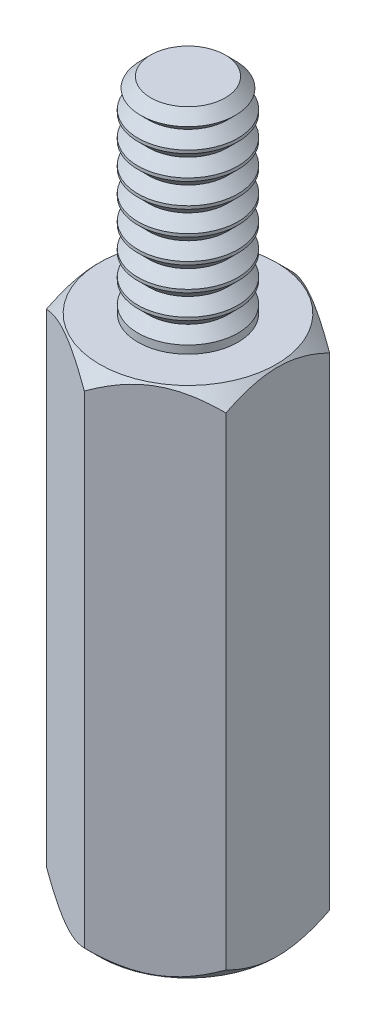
ISO-10303-21;
HEADER;
FILE_DESCRIPTION(('STEP AP214'),'2;1');
FILE_NAME('part.step','',(''),(''),'','','');
FILE_SCHEMA(('AUTOMOTIVE_DESIGN { 1 0 10303 214 1 1 1 1 }'));
ENDSEC;
DATA;
#1=APPLICATION_CONTEXT('core data for automotive mechanical design processes');
#2=APPLICATION_PROTOCOL_DEFINITION('international standard','automotive_design',2000,#1);
#3=PRODUCT_CONTEXT('',#1,'mechanical');
#4=PRODUCT('Part','Part','',(#3));
#5=PRODUCT_RELATED_PRODUCT_CATEGORY('part','',(#4));
#6=PRODUCT_DEFINITION_FORMATION('','',#4);
#7=PRODUCT_DEFINITION_CONTEXT('part definition',#1,'design');
#8=PRODUCT_DEFINITION('design','',#6,#7);
#9=PRODUCT_DEFINITION_SHAPE('','',#8);
#10=(LENGTH_UNIT() NAMED_UNIT(*) SI_UNIT(.MILLI.,.METRE.));
#11=(NAMED_UNIT(*) PLANE_ANGLE_UNIT() SI_UNIT($,.RADIAN.));
#12=(NAMED_UNIT(*) SI_UNIT($,.STERADIAN.) SOLID_ANGLE_UNIT());
#13=UNCERTAINTY_MEASURE_WITH_UNIT(LENGTH_MEASURE(1.E-05),#10,'distance_accuracy_value','');
#14=(GEOMETRIC_REPRESENTATION_CONTEXT(3) GLOBAL_UNCERTAINTY_ASSIGNED_CONTEXT((#13)) GLOBAL_UNIT_ASSIGNED_CONTEXT((#10,
#11,#12)) REPRESENTATION_CONTEXT('',''));
#15=CARTESIAN_POINT('',(0.,0.,0.));
#16=DIRECTION('',(0.,0.,1.));
#17=DIRECTION('',(1.,0.,0.));
#18=AXIS2_PLACEMENT_3D('',#15,#16,#17);
#19=CARTESIAN_POINT('',(0.,28.,0.));
#20=DIRECTION('',(0.,-1.,0.));
#21=DIRECTION('',(0.,0.,-1.));
#22=AXIS2_PLACEMENT_3D('',#19,#20,#21);
#23=CYLINDRICAL_SURFACE('',#22,1.95);
#24=CARTESIAN_POINT('',(0.,23.9502438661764,0.));
#25=DIRECTION('',(0.,-1.,0.));
#26=DIRECTION('',(0.,0.,-1.));
#27=AXIS2_PLACEMENT_3D('',#24,#25,#26);
#28=CIRCLE('',#27,1.95000000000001);
#29=CARTESIAN_POINT('',(0.,23.9502438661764,-1.95000000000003));
#30=VERTEX_POINT('',#29);
#31=EDGE_CURVE('E320',#30,#30,#28,.T.);
#32=ORIENTED_EDGE('',*,*,#31,.F.);
#33=EDGE_LOOP('',(#32));
#34=FACE_BOUND('',#33,.T.);
#35=CARTESIAN_POINT('',(0.,24.07,0.));
#36=DIRECTION('',(0.,-1.,0.));
#37=DIRECTION('',(0.,0.,-1.));
#38=AXIS2_PLACEMENT_3D('',#35,#36,#37);
#39=CIRCLE('',#38,1.95000000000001);
#40=CARTESIAN_POINT('',(0.,24.07,-1.95000000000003));
#41=VERTEX_POINT('',#40);
#42=EDGE_CURVE('E635',#41,#41,#39,.T.);
#43=ORIENTED_EDGE('',*,*,#42,.T.);
#44=EDGE_LOOP('',(#43));
#45=FACE_BOUND('',#44,.T.);
#46=ADVANCED_FACE('F34',(#34,#45),#23,.T.);
#47=CARTESIAN_POINT('',(0.,21.25,0.));
#48=DIRECTION('',(0.,-1.,0.));
#49=DIRECTION('',(0.,0.,-1.));
#50=AXIS2_PLACEMENT_3D('',#47,#48,#49);
#51=CIRCLE('',#50,1.95000000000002);
#52=CARTESIAN_POINT('',(0.,21.25,-1.95000000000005));
#53=VERTEX_POINT('',#52);
#54=EDGE_CURVE('E314',#53,#53,#51,.T.);
#55=ORIENTED_EDGE('',*,*,#54,.T.);
#56=EDGE_LOOP('',(#55));
#57=FACE_BOUND('',#56,.T.);
#58=CARTESIAN_POINT('',(0.,21.1302438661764,0.));
#59=DIRECTION('',(0.,-1.,0.));
#60=DIRECTION('',(0.,0.,-1.));
#61=AXIS2_PLACEMENT_3D('',#58,#59,#60);
#62=CIRCLE('',#61,1.95000000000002);
#63=CARTESIAN_POINT('',(0.,21.1302438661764,-1.95000000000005));
#64=VERTEX_POINT('',#63);
#65=EDGE_CURVE('E363',#64,#64,#62,.T.);
#66=ORIENTED_EDGE('',*,*,#65,.F.);
#67=EDGE_LOOP('',(#66));
#68=FACE_BOUND('',#67,.T.);
#69=ADVANCED_FACE('F240',(#57,#68),#23,.T.);
#70=CARTESIAN_POINT('',(0.,22.19,0.));
#71=DIRECTION('',(0.,-1.,0.));
#72=DIRECTION('',(0.,0.,-1.));
#73=AXIS2_PLACEMENT_3D('',#70,#71,#72);
#74=CIRCLE('',#73,1.95000000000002);
#75=CARTESIAN_POINT('',(0.,22.19,-1.95000000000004));
#76=VERTEX_POINT('',#75);
#77=EDGE_CURVE('E307',#76,#76,#74,.T.);
#78=ORIENTED_EDGE('',*,*,#77,.T.);
#79=EDGE_LOOP('',(#78));
#80=FACE_BOUND('',#79,.T.);
#81=CARTESIAN_POINT('',(0.,22.0702438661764,0.));
#82=DIRECTION('',(0.,-1.,0.));
#83=DIRECTION('',(0.,0.,-1.));
#84=AXIS2_PLACEMENT_3D('',#81,#82,#83);
#85=CIRCLE('',#84,1.95000000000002);
#86=CARTESIAN_POINT('',(0.,22.0702438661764,-1.95000000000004));
#87=VERTEX_POINT('',#86);
#88=EDGE_CURVE('E366',#87,#87,#85,.T.);
#89=ORIENTED_EDGE('',*,*,#88,.F.);
#90=EDGE_LOOP('',(#89));
#91=FACE_BOUND('',#90,.T.);
#92=ADVANCED_FACE('F239',(#80,#91),#23,.T.);
#93=CARTESIAN_POINT('',(0.,23.13,0.));
#94=DIRECTION('',(0.,-1.,0.));
#95=DIRECTION('',(0.,0.,-1.));
#96=AXIS2_PLACEMENT_3D('',#93,#94,#95);
#97=CIRCLE('',#96,1.95000000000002);
#98=CARTESIAN_POINT('',(0.,23.13,-1.95000000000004));
#99=VERTEX_POINT('',#98);
#100=EDGE_CURVE('E302',#99,#99,#97,.T.);
#101=ORIENTED_EDGE('',*,*,#100,.T.);
#102=EDGE_LOOP('',(#101));
#103=FACE_BOUND('',#102,.T.);
#104=CARTESIAN_POINT('',(0.,23.0102438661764,0.));
#105=DIRECTION('',(0.,-1.,0.));
#106=DIRECTION('',(0.,0.,-1.));
#107=AXIS2_PLACEMENT_3D('',#104,#105,#106);
#108=CIRCLE('',#107,1.95000000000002);
#109=CARTESIAN_POINT('',(0.,23.0102438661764,-1.95000000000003));
#110=VERTEX_POINT('',#109);
#111=EDGE_CURVE('E305',#110,#110,#108,.T.);
#112=ORIENTED_EDGE('',*,*,#111,.F.);
#113=EDGE_LOOP('',(#112));
#114=FACE_BOUND('',#113,.T.);
#115=ADVANCED_FACE('F277',(#103,#114),#23,.T.);
#116=CARTESIAN_POINT('',(0.,23.5401219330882,0.));
#117=DIRECTION('',(0.,1.,0.));
#118=DIRECTION('',(0.,0.,1.));
#119=AXIS2_PLACEMENT_3D('',#116,#117,#118);
#120=CONICAL_SURFACE('',#119,1.53987806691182,0.785398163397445);
#121=ORIENTED_EDGE('',*,*,#31,.T.);
#122=EDGE_LOOP('',(#121));
#123=FACE_BOUND('',#122,.T.);
#124=CARTESIAN_POINT('',(0.,23.5401219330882,0.));
#125=DIRECTION('',(0.,-1.,0.));
#126=DIRECTION('',(0.,0.,-1.));
#127=AXIS2_PLACEMENT_3D('',#124,#125,#126);
#128=CIRCLE('',#127,1.53987806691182);
#129=CARTESIAN_POINT('',(0.,23.5401219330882,-1.53987806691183));
#130=VERTEX_POINT('',#129);
#131=EDGE_CURVE('E324',#130,#130,#128,.T.);
#132=ORIENTED_EDGE('',*,*,#131,.F.);
#133=EDGE_LOOP('',(#132));
#134=FACE_BOUND('',#133,.T.);
#135=ADVANCED_FACE('F289',(#123,#134),#120,.T.);
#136=CARTESIAN_POINT('',(0.,23.13,0.));
#137=DIRECTION('',(0.,-1.,0.));
#138=DIRECTION('',(0.,0.,-1.));
#139=AXIS2_PLACEMENT_3D('',#136,#137,#138);
#140=CONICAL_SURFACE('',#139,1.95000000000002,0.785398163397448);
#141=ORIENTED_EDGE('',*,*,#131,.T.);
#142=EDGE_LOOP('',(#141));
#143=FACE_BOUND('',#142,.T.);
#144=ORIENTED_EDGE('',*,*,#100,.F.);
#145=EDGE_LOOP('',(#144));
#146=FACE_BOUND('',#145,.T.);
#147=ADVANCED_FACE('F295',(#143,#146),#140,.T.);
#148=CARTESIAN_POINT('',(0.,22.6001219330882,0.));
#149=DIRECTION('',(0.,1.,0.));
#150=DIRECTION('',(0.,0.,1.));
#151=AXIS2_PLACEMENT_3D('',#148,#149,#150);
#152=CONICAL_SURFACE('',#151,1.53987806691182,0.785398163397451);
#153=ORIENTED_EDGE('',*,*,#111,.T.);
#154=EDGE_LOOP('',(#153));
#155=FACE_BOUND('',#154,.T.);
#156=CARTESIAN_POINT('',(0.,22.6001219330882,0.));
#157=DIRECTION('',(0.,-1.,0.));
#158=DIRECTION('',(0.,0.,-1.));
#159=AXIS2_PLACEMENT_3D('',#156,#157,#158);
#160=CIRCLE('',#159,1.53987806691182);
#161=CARTESIAN_POINT('',(0.,22.6001219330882,-1.53987806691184));
#162=VERTEX_POINT('',#161);
#163=EDGE_CURVE('E311',#162,#162,#160,.T.);
#164=ORIENTED_EDGE('',*,*,#163,.F.);
#165=EDGE_LOOP('',(#164));
#166=FACE_BOUND('',#165,.T.);
#167=ADVANCED_FACE('F395',(#155,#166),#152,.T.);
#168=CARTESIAN_POINT('',(0.,22.19,0.));
#169=DIRECTION('',(0.,-1.,0.));
#170=DIRECTION('',(0.,0.,-1.));
#171=AXIS2_PLACEMENT_3D('',#168,#169,#170);
#172=CONICAL_SURFACE('',#171,1.95000000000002,0.785398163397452);
#173=ORIENTED_EDGE('',*,*,#163,.T.);
#174=EDGE_LOOP('',(#173));
#175=FACE_BOUND('',#174,.T.);
#176=ORIENTED_EDGE('',*,*,#77,.F.);
#177=EDGE_LOOP('',(#176));
#178=FACE_BOUND('',#177,.T.);
#179=ADVANCED_FACE('F390',(#175,#178),#172,.T.);
#180=CARTESIAN_POINT('',(0.,21.6601219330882,0.));
#181=DIRECTION('',(0.,1.,0.));
#182=DIRECTION('',(0.,0.,1.));
#183=AXIS2_PLACEMENT_3D('',#180,#181,#182);
#184=CONICAL_SURFACE('',#183,1.53987806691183,0.785398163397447);
#185=ORIENTED_EDGE('',*,*,#88,.T.);
#186=EDGE_LOOP('',(#185));
#187=FACE_BOUND('',#186,.T.);
#188=CARTESIAN_POINT('',(0.,21.6601219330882,0.));
#189=DIRECTION('',(0.,-1.,0.));
#190=DIRECTION('',(0.,0.,-1.));
#191=AXIS2_PLACEMENT_3D('',#188,#189,#190);
#192=CIRCLE('',#191,1.53987806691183);
#193=CARTESIAN_POINT('',(0.,21.6601219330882,-1.53987806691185));
#194=VERTEX_POINT('',#193);
#195=EDGE_CURVE('E308',#194,#194,#192,.T.);
#196=ORIENTED_EDGE('',*,*,#195,.F.);
#197=EDGE_LOOP('',(#196));
#198=FACE_BOUND('',#197,.T.);
#199=ADVANCED_FACE('F381',(#187,#198),#184,.T.);
#200=CARTESIAN_POINT('',(0.,21.25,0.));
#201=DIRECTION('',(0.,-1.,0.));
#202=DIRECTION('',(0.,0.,-1.));
#203=AXIS2_PLACEMENT_3D('',#200,#201,#202);
#204=CONICAL_SURFACE('',#203,1.95000000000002,0.785398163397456);
#205=ORIENTED_EDGE('',*,*,#195,.T.);
#206=EDGE_LOOP('',(#205));
#207=FACE_BOUND('',#206,.T.);
#208=ORIENTED_EDGE('',*,*,#54,.F.);
#209=EDGE_LOOP('',(#208));
#210=FACE_BOUND('',#209,.T.);
#211=ADVANCED_FACE('F378',(#207,#210),#204,.T.);
#212=CARTESIAN_POINT('',(0.,20.7201219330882,0.));
#213=DIRECTION('',(0.,1.,0.));
#214=DIRECTION('',(0.,0.,1.));
#215=AXIS2_PLACEMENT_3D('',#212,#213,#214);
#216=CONICAL_SURFACE('',#215,1.53987806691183,0.785398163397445);
#217=ORIENTED_EDGE('',*,*,#65,.T.);
#218=EDGE_LOOP('',(#217));
#219=FACE_BOUND('',#218,.T.);
#220=CARTESIAN_POINT('',(0.,20.7201219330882,0.));
#221=DIRECTION('',(0.,-1.,0.));
#222=DIRECTION('',(0.,0.,-1.));
#223=AXIS2_PLACEMENT_3D('',#220,#221,#222);
#224=CIRCLE('',#223,1.53987806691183);
#225=CARTESIAN_POINT('',(0.,20.7201219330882,-1.53987806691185));
#226=VERTEX_POINT('',#225);
#227=EDGE_CURVE('E362',#226,#226,#224,.T.);
#228=ORIENTED_EDGE('',*,*,#227,.F.);
#229=EDGE_LOOP('',(#228));
#230=FACE_BOUND('',#229,.T.);
#231=ADVANCED_FACE('F380',(#219,#230),#216,.T.);
#232=CARTESIAN_POINT('',(0.,20.31,0.));
#233=DIRECTION('',(0.,-1.,0.));
#234=DIRECTION('',(0.,0.,-1.));
#235=AXIS2_PLACEMENT_3D('',#232,#233,#234);
#236=CONICAL_SURFACE('',#235,1.95000000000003,0.785398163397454);
#237=ORIENTED_EDGE('',*,*,#227,.T.);
#238=EDGE_LOOP('',(#237));
#239=FACE_BOUND('',#238,.T.);
#240=CARTESIAN_POINT('',(0.,20.31,0.));
#241=DIRECTION('',(0.,-1.,0.));
#242=DIRECTION('',(0.,0.,-1.));
#243=AXIS2_PLACEMENT_3D('',#240,#241,#242);
#244=CIRCLE('',#243,1.95000000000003);
#245=CARTESIAN_POINT('',(0.,20.31,-1.95000000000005));
#246=VERTEX_POINT('',#245);
#247=EDGE_CURVE('E360',#246,#246,#244,.T.);
#248=ORIENTED_EDGE('',*,*,#247,.F.);
#249=EDGE_LOOP('',(#248));
#250=FACE_BOUND('',#249,.T.);
#251=ADVANCED_FACE('F227',(#239,#250),#236,.T.);
#252=CARTESIAN_POINT('',(0.,0.,0.));
#253=DIRECTION('',(0.,1.,0.));
#254=DIRECTION('',(0.,0.,1.));
#255=AXIS2_PLACEMENT_3D('',#252,#253,#254);
#256=PLANE('',#255);
#257=CARTESIAN_POINT('',(0.,0.,0.));
#258=DIRECTION('',(0.,-1.,0.));
#259=DIRECTION('',(0.,0.,-1.));
#260=AXIS2_PLACEMENT_3D('',#257,#258,#259);
#261=CIRCLE('',#260,1.95);
#262=CARTESIAN_POINT('',(0.,0.,-1.95));
#263=VERTEX_POINT('',#262);
#264=EDGE_CURVE('E636',#263,#263,#261,.T.);
#265=ORIENTED_EDGE('',*,*,#264,.F.);
#266=EDGE_LOOP('',(#265));
#267=FACE_BOUND('',#266,.T.);
#268=CARTESIAN_POINT('',(0.,0.,0.));
#269=DIRECTION('',(0.,1.,0.));
#270=DIRECTION('',(0.,0.,1.));
#271=AXIS2_PLACEMENT_3D('',#268,#269,#270);
#272=CIRCLE('',#271,3.44145188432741);
#273=CARTESIAN_POINT('',(0.,0.,3.44145188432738));
#274=VERTEX_POINT('',#273);
#275=EDGE_CURVE('E353',#274,#274,#272,.T.);
#276=ORIENTED_EDGE('',*,*,#275,.F.);
#277=EDGE_LOOP('',(#276));
#278=FACE_BOUND('',#277,.T.);
#279=ADVANCED_FACE('F154',(#267,#278),#256,.F.);
#280=CARTESIAN_POINT('',(0.,0.,0.));
#281=DIRECTION('',(0.,1.,0.));
#282=DIRECTION('',(0.,0.,1.));
#283=AXIS2_PLACEMENT_3D('',#280,#281,#282);
#284=CONICAL_SURFACE('',#283,3.44145188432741,0.785398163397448);
#285=ORIENTED_EDGE('',*,*,#275,.T.);
#286=EDGE_LOOP('',(#285));
#287=FACE_BOUND('',#286,.T.);
#288=CARTESIAN_POINT('',(3.5,2.02072419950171,-4.19349109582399));
#289=CARTESIAN_POINT('',(3.5,1.94289024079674,-4.0920866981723));
#290=CARTESIAN_POINT('',(3.5,1.86576032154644,-3.99013324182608));
#291=CARTESIAN_POINT('',(3.5,1.71322942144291,-3.78490475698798));
#292=CARTESIAN_POINT('',(3.5,1.63782885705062,-3.68162941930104));
#293=CARTESIAN_POINT('',(3.5,1.48854088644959,-3.47277876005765));
#294=CARTESIAN_POINT('',(3.5,1.41466965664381,-3.36719183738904));
#295=CARTESIAN_POINT('',(3.5,1.26952037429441,-3.15425614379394));
#296=CARTESIAN_POINT('',(3.5,1.19824214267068,-3.04690749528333));
#297=CARTESIAN_POINT('',(3.5,1.05450441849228,-2.82336801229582));
#298=CARTESIAN_POINT('',(3.5,0.982250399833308,-2.70704438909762));
#299=CARTESIAN_POINT('',(3.5,0.842259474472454,-2.47166706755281));
#300=CARTESIAN_POINT('',(3.5,0.774523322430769,-2.35261291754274));
#301=CARTESIAN_POINT('',(3.5,0.645013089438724,-2.11174739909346));
#302=CARTESIAN_POINT('',(3.5,0.583221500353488,-1.9899455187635));
#303=CARTESIAN_POINT('',(3.5,0.466984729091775,-1.74291320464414));
#304=CARTESIAN_POINT('',(3.5,0.412536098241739,-1.61768441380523));
#305=CARTESIAN_POINT('',(3.5,0.317760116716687,-1.37579906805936));
#306=CARTESIAN_POINT('',(3.5,0.276577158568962,-1.25948120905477));
#307=CARTESIAN_POINT('',(3.5,0.203523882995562,-1.02390221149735));
#308=CARTESIAN_POINT('',(3.5,0.171654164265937,-0.904640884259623));
#309=CARTESIAN_POINT('',(3.5,0.119475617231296,-0.665952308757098));
#310=CARTESIAN_POINT('',(3.5,0.0989583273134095,-0.546571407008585));
#311=CARTESIAN_POINT('',(3.5,0.069909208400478,-0.306352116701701));
#312=CARTESIAN_POINT('',(3.5,0.0613749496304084,-0.185514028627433));
#313=CARTESIAN_POINT('',(3.5,0.0570073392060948,0.0512281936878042));
#314=CARTESIAN_POINT('',(3.5,0.0606472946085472,0.167122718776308));
#315=CARTESIAN_POINT('',(3.5,0.0792233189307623,0.39799675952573));
#316=CARTESIAN_POINT('',(3.5,0.0941604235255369,0.512976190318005));
#317=CARTESIAN_POINT('',(3.5,0.134743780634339,0.743135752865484));
#318=CARTESIAN_POINT('',(3.5,0.160578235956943,0.858282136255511));
#319=CARTESIAN_POINT('',(3.5,0.221530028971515,1.08604290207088));
#320=CARTESIAN_POINT('',(3.5,0.256646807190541,1.19865743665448));
#321=CARTESIAN_POINT('',(3.5,0.337043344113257,1.42803237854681));
#322=CARTESIAN_POINT('',(3.5,0.382817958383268,1.54461737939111));
#323=CARTESIAN_POINT('',(3.5,0.481428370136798,1.77477031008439));
#324=CARTESIAN_POINT('',(3.5,0.534266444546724,1.88833725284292));
#325=CARTESIAN_POINT('',(3.5,0.645758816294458,2.11301559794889));
#326=CARTESIAN_POINT('',(3.5,0.704431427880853,2.22411783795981));
#327=CARTESIAN_POINT('',(3.5,0.826298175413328,2.44377531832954));
#328=CARTESIAN_POINT('',(3.5,0.889491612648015,2.55233094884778));
#329=CARTESIAN_POINT('',(3.5,1.01630412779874,2.76191944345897));
#330=CARTESIAN_POINT('',(3.5,1.07974785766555,2.86305896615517));
#331=CARTESIAN_POINT('',(3.5,1.20933246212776,3.06360047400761));
#332=CARTESIAN_POINT('',(3.5,1.27547353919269,3.16300232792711));
#333=CARTESIAN_POINT('',(3.5,1.40943239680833,3.35949586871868));
#334=CARTESIAN_POINT('',(3.5,1.47723242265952,3.45659970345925));
#335=CARTESIAN_POINT('',(3.5,1.61464743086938,3.6494757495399));
#336=CARTESIAN_POINT('',(3.5,1.68426190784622,3.74524832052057));
#337=CARTESIAN_POINT('',(3.5,1.75461899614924,3.84046254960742));
#338=B_SPLINE_CURVE_WITH_KNOTS('',3,(#288,#289,#290,#291,#292,#293,#294,#295,#296,#297,#298,
#299,#300,#301,#302,#303,#304,#305,#306,#307,#308,#309,#310,#311,#312,#313,#314,#315,#316,#317,
#318,#319,#320,#321,#322,#323,#324,#325,#326,#327,#328,#329,#330,#331,#332,#333,#334,#335,#336,
#337),.UNSPECIFIED.,.F.,.F.,(4,2,2,2,2,2,2,2,2,2,2,2,2,2,2,2,2,2,2,2,2,2,2,2,4),(0.,
0.383502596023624,0.767096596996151,1.15365209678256,1.54018084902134,1.95091122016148,
2.36171002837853,2.77125931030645,3.18061556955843,3.55047538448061,3.92035897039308,
4.28320370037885,4.64597484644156,4.99325794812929,5.34057289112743,5.69414898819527,
6.04770377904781,6.42316312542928,6.79874379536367,7.1755430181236,7.55228413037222,
7.91040820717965,8.26855921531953,8.62383088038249,8.97900462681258),.UNSPECIFIED.);
#339=CARTESIAN_POINT('',(3.5,0.6,2.02072594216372));
#340=VERTEX_POINT('',#339);
#341=CARTESIAN_POINT('',(3.5,0.599999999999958,-2.02072594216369));
#342=VERTEX_POINT('',#341);
#343=EDGE_CURVE('E91',#340,#342,#338,.F.);
#344=ORIENTED_EDGE('',*,*,#343,.F.);
#345=CARTESIAN_POINT('',(-0.000200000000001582,0.600115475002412,4.04156735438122));
#346=CARTESIAN_POINT('',(0.120108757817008,0.530715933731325,3.9721070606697));
#347=CARTESIAN_POINT('',(0.242429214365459,0.465392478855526,3.90148531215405));
#348=CARTESIAN_POINT('',(0.491853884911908,0.345787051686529,3.75747991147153));
#349=CARTESIAN_POINT('',(0.618981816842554,0.29157162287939,3.68408256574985));
#350=CARTESIAN_POINT('',(0.875329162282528,0.198699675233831,3.53608035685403));
#351=CARTESIAN_POINT('',(1.00448329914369,0.159809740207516,3.46151318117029));
#352=CARTESIAN_POINT('',(1.26563479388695,0.0998919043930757,3.31073729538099));
#353=CARTESIAN_POINT('',(1.39762417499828,0.0788192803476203,3.23453319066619));
#354=CARTESIAN_POINT('',(1.62510370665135,0.0598061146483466,3.10319782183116));
#355=CARTESIAN_POINT('',(1.72030010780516,0.0569916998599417,3.04823615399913));
#356=CARTESIAN_POINT('',(1.91053805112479,0.0617346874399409,2.93840222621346));
#357=CARTESIAN_POINT('',(2.00557952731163,0.0692957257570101,2.88353000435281));
#358=CARTESIAN_POINT('',(2.19476205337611,0.0943578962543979,2.77430542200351));
#359=CARTESIAN_POINT('',(2.2889019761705,0.111870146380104,2.71995371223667));
#360=CARTESIAN_POINT('',(2.47556499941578,0.155878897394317,2.61218376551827));
#361=CARTESIAN_POINT('',(2.56808822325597,0.182374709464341,2.55876545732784));
#362=CARTESIAN_POINT('',(2.73234167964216,0.236887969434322,2.46393368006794));
#363=CARTESIAN_POINT('',(2.80443551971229,0.263472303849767,2.42231028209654));
#364=CARTESIAN_POINT('',(2.9473289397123,0.320925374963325,2.33981072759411));
#365=CARTESIAN_POINT('',(3.01812848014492,0.351794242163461,2.29893459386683));
#366=CARTESIAN_POINT('',(3.15821024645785,0.417124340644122,2.21805834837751));
#367=CARTESIAN_POINT('',(3.22749645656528,0.451574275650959,2.17805593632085));
#368=CARTESIAN_POINT('',(3.36478573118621,0.523614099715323,2.09879193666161));
#369=CARTESIAN_POINT('',(3.43278955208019,0.561202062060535,2.05952991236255));
#370=CARTESIAN_POINT('',(3.5002,0.600115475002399,2.02061047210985));
#371=B_SPLINE_CURVE_WITH_KNOTS('',3,(#345,#346,#347,#348,#349,#350,#351,#352,#353,#354,#355,
#356,#357,#358,#359,#360,#361,#362,#363,#364,#365,#366,#367,#368,#369,#370),.UNSPECIFIED.,.F.,
.F.,(4,2,2,2,2,2,2,2,2,2,2,2,4),(0.,0.466195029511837,0.93510605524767,1.39657035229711,
1.85687285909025,2.18628459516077,2.51581179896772,2.84570789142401,3.17557869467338,
3.4376213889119,3.69967206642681,3.96091985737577,4.22200840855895),.UNSPECIFIED.);
#372=CARTESIAN_POINT('',(0.,0.6,4.04145188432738));
#373=VERTEX_POINT('',#372);
#374=EDGE_CURVE('E86',#373,#340,#371,.T.);
#375=ORIENTED_EDGE('',*,*,#374,.F.);
#376=CARTESIAN_POINT('',(-3.5002,0.600115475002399,2.02061047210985));
#377=CARTESIAN_POINT('',(-3.37989124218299,0.530715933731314,2.09007076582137));
#378=CARTESIAN_POINT('',(-3.25757078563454,0.465392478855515,2.16069251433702));
#379=CARTESIAN_POINT('',(-3.0081461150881,0.34578705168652,2.30469791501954));
#380=CARTESIAN_POINT('',(-2.88101818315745,0.291571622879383,2.37809526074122));
#381=CARTESIAN_POINT('',(-2.62467083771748,0.198699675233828,2.52609746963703));
#382=CARTESIAN_POINT('',(-2.49551670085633,0.159809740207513,2.60066464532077));
#383=CARTESIAN_POINT('',(-2.23436520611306,0.0998919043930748,2.75144053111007));
#384=CARTESIAN_POINT('',(-2.10237582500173,0.0788192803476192,2.82764463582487));
#385=CARTESIAN_POINT('',(-1.87489629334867,0.0598061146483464,2.95898000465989));
#386=CARTESIAN_POINT('',(-1.77969989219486,0.0569916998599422,3.01394167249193));
#387=CARTESIAN_POINT('',(-1.58946194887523,0.0617346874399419,3.1237756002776));
#388=CARTESIAN_POINT('',(-1.49442047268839,0.0692957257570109,3.17864782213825));
#389=CARTESIAN_POINT('',(-1.30523794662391,0.0943578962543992,3.28787240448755));
#390=CARTESIAN_POINT('',(-1.21109802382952,0.111870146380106,3.34222411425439));
#391=CARTESIAN_POINT('',(-1.02443500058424,0.155878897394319,3.44999406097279));
#392=CARTESIAN_POINT('',(-0.931911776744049,0.182374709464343,3.50341236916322));
#393=CARTESIAN_POINT('',(-0.767658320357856,0.236887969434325,3.59824414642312));
#394=CARTESIAN_POINT('',(-0.695564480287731,0.26347230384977,3.63986754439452));
#395=CARTESIAN_POINT('',(-0.552671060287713,0.32092537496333,3.72236709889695));
#396=CARTESIAN_POINT('',(-0.48187151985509,0.351794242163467,3.76324323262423));
#397=CARTESIAN_POINT('',(-0.34178975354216,0.417124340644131,3.84411947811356));
#398=CARTESIAN_POINT('',(-0.272503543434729,0.451574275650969,3.88412189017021));
#399=CARTESIAN_POINT('',(-0.13521426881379,0.523614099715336,3.96338588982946));
#400=CARTESIAN_POINT('',(-0.0672104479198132,0.561202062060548,4.00264791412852));
#401=CARTESIAN_POINT('',(0.000199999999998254,0.600115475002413,4.04156735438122));
#402=B_SPLINE_CURVE_WITH_KNOTS('',3,(#376,#377,#378,#379,#380,#381,#382,#383,#384,#385,#386,
#387,#388,#389,#390,#391,#392,#393,#394,#395,#396,#397,#398,#399,#400,#401),.UNSPECIFIED.,.F.,
.F.,(4,2,2,2,2,2,2,2,2,2,2,2,4),(0.,0.46619502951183,0.935106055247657,1.39657035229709,
1.85687285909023,2.18628459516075,2.5158117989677,2.84570789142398,3.17557869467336,
3.43762138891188,3.6996720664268,3.96091985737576,4.22200840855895),.UNSPECIFIED.);
#403=CARTESIAN_POINT('',(-3.50000000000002,0.6,2.02072594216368));
#404=VERTEX_POINT('',#403);
#405=EDGE_CURVE('E89',#404,#373,#402,.T.);
#406=ORIENTED_EDGE('',*,*,#405,.F.);
#407=CARTESIAN_POINT('',(-3.5,2.02072419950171,-4.19349109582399));
#408=CARTESIAN_POINT('',(-3.5,1.94289024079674,-4.09208669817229));
#409=CARTESIAN_POINT('',(-3.5,1.86576032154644,-3.99013324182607));
#410=CARTESIAN_POINT('',(-3.5,1.71322942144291,-3.78490475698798));
#411=CARTESIAN_POINT('',(-3.5,1.63782885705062,-3.68162941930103));
#412=CARTESIAN_POINT('',(-3.5,1.48854088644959,-3.47277876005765));
#413=CARTESIAN_POINT('',(-3.5,1.41466965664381,-3.36719183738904));
#414=CARTESIAN_POINT('',(-3.5,1.26952037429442,-3.15425614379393));
#415=CARTESIAN_POINT('',(-3.5,1.19824214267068,-3.04690749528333));
#416=CARTESIAN_POINT('',(-3.5,1.05450441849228,-2.82336801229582));
#417=CARTESIAN_POINT('',(-3.5,0.982250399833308,-2.70704438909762));
#418=CARTESIAN_POINT('',(-3.5,0.842259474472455,-2.47166706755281));
#419=CARTESIAN_POINT('',(-3.5,0.774523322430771,-2.35261291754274));
#420=CARTESIAN_POINT('',(-3.5,0.645013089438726,-2.11174739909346));
#421=CARTESIAN_POINT('',(-3.5,0.583221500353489,-1.9899455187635));
#422=CARTESIAN_POINT('',(-3.5,0.466984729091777,-1.74291320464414));
#423=CARTESIAN_POINT('',(-3.5,0.412536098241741,-1.61768441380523));
#424=CARTESIAN_POINT('',(-3.5,0.317760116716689,-1.37579906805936));
#425=CARTESIAN_POINT('',(-3.5,0.276577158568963,-1.25948120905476));
#426=CARTESIAN_POINT('',(-3.5,0.203523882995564,-1.02390221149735));
#427=CARTESIAN_POINT('',(-3.5,0.171654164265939,-0.904640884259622));
#428=CARTESIAN_POINT('',(-3.5,0.119475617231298,-0.665952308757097));
#429=CARTESIAN_POINT('',(-3.5,0.098958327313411,-0.546571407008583));
#430=CARTESIAN_POINT('',(-3.5,0.0699092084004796,-0.306352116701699));
#431=CARTESIAN_POINT('',(-3.5,0.0613749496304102,-0.18551402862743));
#432=CARTESIAN_POINT('',(-3.5,0.0570073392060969,0.0512281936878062));
#433=CARTESIAN_POINT('',(-3.5,0.0606472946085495,0.16712271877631));
#434=CARTESIAN_POINT('',(-3.5,0.0792233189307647,0.397996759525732));
#435=CARTESIAN_POINT('',(-3.5,0.0941604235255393,0.512976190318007));
#436=CARTESIAN_POINT('',(-3.5,0.134743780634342,0.743135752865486));
#437=CARTESIAN_POINT('',(-3.5,0.160578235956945,0.858282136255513));
#438=CARTESIAN_POINT('',(-3.5,0.221530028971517,1.08604290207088));
#439=CARTESIAN_POINT('',(-3.5,0.256646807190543,1.19865743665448));
#440=CARTESIAN_POINT('',(-3.5,0.33704334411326,1.42803237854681));
#441=CARTESIAN_POINT('',(-3.5,0.382817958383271,1.54461737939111));
#442=CARTESIAN_POINT('',(-3.5,0.481428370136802,1.7747703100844));
#443=CARTESIAN_POINT('',(-3.5,0.534266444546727,1.88833725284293));
#444=CARTESIAN_POINT('',(-3.5,0.645758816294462,2.1130155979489));
#445=CARTESIAN_POINT('',(-3.5,0.704431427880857,2.22411783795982));
#446=CARTESIAN_POINT('',(-3.5,0.826298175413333,2.44377531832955));
#447=CARTESIAN_POINT('',(-3.5,0.88949161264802,2.55233094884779));
#448=CARTESIAN_POINT('',(-3.5,1.01630412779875,2.76191944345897));
#449=CARTESIAN_POINT('',(-3.5,1.07974785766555,2.86305896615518));
#450=CARTESIAN_POINT('',(-3.5,1.20933246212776,3.06360047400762));
#451=CARTESIAN_POINT('',(-3.5,1.2754735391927,3.16300232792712));
#452=CARTESIAN_POINT('',(-3.5,1.40943239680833,3.35949586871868));
#453=CARTESIAN_POINT('',(-3.5,1.47723242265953,3.45659970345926));
#454=CARTESIAN_POINT('',(-3.5,1.61464743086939,3.64947574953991));
#455=CARTESIAN_POINT('',(-3.5,1.68426190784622,3.74524832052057));
#456=CARTESIAN_POINT('',(-3.5,1.75461899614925,3.84046254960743));
#457=B_SPLINE_CURVE_WITH_KNOTS('',3,(#407,#408,#409,#410,#411,#412,#413,#414,#415,#416,#417,
#418,#419,#420,#421,#422,#423,#424,#425,#426,#427,#428,#429,#430,#431,#432,#433,#434,#435,#436,
#437,#438,#439,#440,#441,#442,#443,#444,#445,#446,#447,#448,#449,#450,#451,#452,#453,#454,#455,
#456),.UNSPECIFIED.,.F.,.F.,(4,2,2,2,2,2,2,2,2,2,2,2,2,2,2,2,2,2,2,2,2,2,2,2,4),(0.,
0.383502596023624,0.76709659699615,1.15365209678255,1.54018084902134,1.95091122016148,
2.36171002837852,2.77125931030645,3.18061556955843,3.55047538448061,3.92035897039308,
4.28320370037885,4.64597484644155,4.99325794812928,5.34057289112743,5.69414898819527,
6.04770377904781,6.42316312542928,6.79874379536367,7.1755430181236,7.55228413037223,
7.91040820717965,8.26855921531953,8.62383088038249,8.97900462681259),.UNSPECIFIED.);
#458=CARTESIAN_POINT('',(-3.5,0.6,-2.02072594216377));
#459=VERTEX_POINT('',#458);
#460=EDGE_CURVE('E105',#459,#404,#457,.T.);
#461=ORIENTED_EDGE('',*,*,#460,.F.);
#462=CARTESIAN_POINT('',(0.000200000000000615,0.600115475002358,-4.04156735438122));
#463=CARTESIAN_POINT('',(-0.120108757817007,0.530715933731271,-3.9721070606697));
#464=CARTESIAN_POINT('',(-0.242429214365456,0.465392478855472,-3.90148531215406));
#465=CARTESIAN_POINT('',(-0.491853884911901,0.345787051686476,-3.75747991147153));
#466=CARTESIAN_POINT('',(-0.618981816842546,0.291571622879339,-3.68408256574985));
#467=CARTESIAN_POINT('',(-0.875329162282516,0.198699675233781,-3.53608035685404));
#468=CARTESIAN_POINT('',(-1.00448329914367,0.159809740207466,-3.4615131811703));
#469=CARTESIAN_POINT('',(-1.26563479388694,0.0998919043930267,-3.310737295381));
#470=CARTESIAN_POINT('',(-1.39762417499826,0.0788192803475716,-3.23453319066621));
#471=CARTESIAN_POINT('',(-1.62510370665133,0.0598061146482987,-3.10319782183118));
#472=CARTESIAN_POINT('',(-1.72030010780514,0.0569916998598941,-3.04823615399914));
#473=CARTESIAN_POINT('',(-1.91053805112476,0.0617346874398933,-2.93840222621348));
#474=CARTESIAN_POINT('',(-2.0055795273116,0.0692957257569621,-2.88353000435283));
#475=CARTESIAN_POINT('',(-2.19476205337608,0.09435789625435,-2.77430542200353));
#476=CARTESIAN_POINT('',(-2.28890197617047,0.111870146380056,-2.71995371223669));
#477=CARTESIAN_POINT('',(-2.47556499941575,0.155878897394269,-2.61218376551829));
#478=CARTESIAN_POINT('',(-2.56808822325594,0.182374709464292,-2.55876545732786));
#479=CARTESIAN_POINT('',(-2.73234167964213,0.236887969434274,-2.46393368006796));
#480=CARTESIAN_POINT('',(-2.80443551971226,0.26347230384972,-2.42231028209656));
#481=CARTESIAN_POINT('',(-2.94732893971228,0.320925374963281,-2.33981072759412));
#482=CARTESIAN_POINT('',(-3.0181284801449,0.351794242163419,-2.29893459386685));
#483=CARTESIAN_POINT('',(-3.15821024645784,0.417124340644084,-2.21805834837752));
#484=CARTESIAN_POINT('',(-3.22749645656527,0.451574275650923,-2.17805593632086));
#485=CARTESIAN_POINT('',(-3.36478573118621,0.523614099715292,-2.09879193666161));
#486=CARTESIAN_POINT('',(-3.43278955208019,0.561202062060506,-2.05952991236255));
#487=CARTESIAN_POINT('',(-3.5002,0.600115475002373,-2.02061047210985));
#488=B_SPLINE_CURVE_WITH_KNOTS('',3,(#462,#463,#464,#465,#466,#467,#468,#469,#470,#471,#472,
#473,#474,#475,#476,#477,#478,#479,#480,#481,#482,#483,#484,#485,#486,#487),.UNSPECIFIED.,.F.,
.F.,(4,2,2,2,2,2,2,2,2,2,2,2,4),(0.,0.46619502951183,0.935106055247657,1.39657035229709,
1.85687285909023,2.18628459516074,2.51581179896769,2.84570789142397,3.17557869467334,
3.43762138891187,3.69967206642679,3.96091985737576,4.22200840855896),.UNSPECIFIED.);
#489=CARTESIAN_POINT('',(0.,0.6,-4.04145188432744));
#490=VERTEX_POINT('',#489);
#491=EDGE_CURVE('E125',#490,#459,#488,.T.);
#492=ORIENTED_EDGE('',*,*,#491,.F.);
#493=CARTESIAN_POINT('',(3.5002,0.600115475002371,-2.02061047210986));
#494=CARTESIAN_POINT('',(3.37989124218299,0.530715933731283,-2.09007076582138));
#495=CARTESIAN_POINT('',(3.25757078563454,0.465392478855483,-2.16069251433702));
#496=CARTESIAN_POINT('',(3.00814611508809,0.345787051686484,-2.30469791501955));
#497=CARTESIAN_POINT('',(2.88101818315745,0.291571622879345,-2.37809526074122));
#498=CARTESIAN_POINT('',(2.62467083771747,0.198699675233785,-2.52609746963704));
#499=CARTESIAN_POINT('',(2.49551670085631,0.15980974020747,-2.60066464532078));
#500=CARTESIAN_POINT('',(2.23436520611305,0.0998919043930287,-2.75144053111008));
#501=CARTESIAN_POINT('',(2.10237582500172,0.0788192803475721,-2.82764463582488));
#502=CARTESIAN_POINT('',(1.87489629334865,0.0598061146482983,-2.95898000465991));
#503=CARTESIAN_POINT('',(1.77969989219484,0.0569916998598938,-3.01394167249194));
#504=CARTESIAN_POINT('',(1.58946194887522,0.061734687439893,-3.12377560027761));
#505=CARTESIAN_POINT('',(1.49442047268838,0.0692957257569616,-3.17864782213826));
#506=CARTESIAN_POINT('',(1.3052379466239,0.0943578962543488,-3.28787240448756));
#507=CARTESIAN_POINT('',(1.21109802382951,0.111870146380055,-3.34222411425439));
#508=CARTESIAN_POINT('',(1.02443500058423,0.155878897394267,-3.4499940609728));
#509=CARTESIAN_POINT('',(0.931911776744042,0.182374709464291,-3.50341236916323));
#510=CARTESIAN_POINT('',(0.767658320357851,0.236887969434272,-3.59824414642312));
#511=CARTESIAN_POINT('',(0.695564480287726,0.263472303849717,-3.63986754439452));
#512=CARTESIAN_POINT('',(0.552671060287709,0.320925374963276,-3.72236709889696));
#513=CARTESIAN_POINT('',(0.481871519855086,0.351794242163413,-3.76324323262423));
#514=CARTESIAN_POINT('',(0.341789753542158,0.417124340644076,-3.84411947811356));
#515=CARTESIAN_POINT('',(0.272503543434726,0.451574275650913,-3.88412189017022));
#516=CARTESIAN_POINT('',(0.135214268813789,0.523614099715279,-3.96338588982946));
#517=CARTESIAN_POINT('',(0.0672104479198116,0.561202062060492,-4.00264791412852));
#518=CARTESIAN_POINT('',(-0.000199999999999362,0.600115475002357,-4.04156735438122));
#519=B_SPLINE_CURVE_WITH_KNOTS('',3,(#493,#494,#495,#496,#497,#498,#499,#500,#501,#502,#503,
#504,#505,#506,#507,#508,#509,#510,#511,#512,#513,#514,#515,#516,#517,#518),.UNSPECIFIED.,.F.,
.F.,(4,2,2,2,2,2,2,2,2,2,2,2,4),(0.,0.466195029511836,0.935106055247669,1.39657035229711,
1.85687285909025,2.18628459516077,2.51581179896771,2.845707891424,3.17557869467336,
3.43762138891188,3.69967206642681,3.96091985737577,4.22200840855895),.UNSPECIFIED.);
#520=EDGE_CURVE('E50',#342,#490,#519,.T.);
#521=ORIENTED_EDGE('',*,*,#520,.F.);
#522=EDGE_LOOP('',(#344,#375,#406,#461,#492,#521));
#523=FACE_BOUND('',#522,.T.);
#524=ADVANCED_FACE('F88',(#287,#523),#284,.T.);
#525=CARTESIAN_POINT('',(3.5,20.,-2.02072594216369));
#526=DIRECTION('',(-0.5,0.,0.866025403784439));
#527=DIRECTION('',(0.866025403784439,0.,0.5));
#528=AXIS2_PLACEMENT_3D('',#525,#526,#527);
#529=PLANE('',#528);
#530=DIRECTION('',(0.,-1.,0.));
#531=VECTOR('',#530,1.);
#532=CARTESIAN_POINT('',(3.5,20.,-2.02072594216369));
#533=LINE('',#532,#531);
#534=CARTESIAN_POINT('',(3.5,19.4,-2.02072594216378));
#535=VERTEX_POINT('',#534);
#536=EDGE_CURVE('E112',#535,#342,#533,.T.);
#537=ORIENTED_EDGE('',*,*,#536,.T.);
#538=ORIENTED_EDGE('',*,*,#520,.T.);
#539=DIRECTION('',(0.,-1.,0.));
#540=VECTOR('',#539,1.);
#541=CARTESIAN_POINT('',(0.,20.,-4.04145188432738));
#542=LINE('',#541,#540);
#543=CARTESIAN_POINT('',(0.,19.4,-4.04145188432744));
#544=VERTEX_POINT('',#543);
#545=EDGE_CURVE('E43',#544,#490,#542,.T.);
#546=ORIENTED_EDGE('',*,*,#545,.F.);
#547=CARTESIAN_POINT('',(-0.000199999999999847,19.3998845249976,-4.04156735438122));
#548=CARTESIAN_POINT('',(0.120108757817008,19.4692840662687,-3.9721070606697));
#549=CARTESIAN_POINT('',(0.242429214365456,19.5346075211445,-3.90148531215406));
#550=CARTESIAN_POINT('',(0.491853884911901,19.6542129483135,-3.75747991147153));
#551=CARTESIAN_POINT('',(0.618981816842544,19.7084283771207,-3.68408256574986));
#552=CARTESIAN_POINT('',(0.875329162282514,19.8013003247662,-3.53608035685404));
#553=CARTESIAN_POINT('',(1.00448329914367,19.8401902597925,-3.4615131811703));
#554=CARTESIAN_POINT('',(1.26563479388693,19.900108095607,-3.310737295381));
#555=CARTESIAN_POINT('',(1.39762417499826,19.9211807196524,-3.23453319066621));
#556=CARTESIAN_POINT('',(1.62510370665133,19.9401938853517,-3.10319782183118));
#557=CARTESIAN_POINT('',(1.72030010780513,19.9430083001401,-3.04823615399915));
#558=CARTESIAN_POINT('',(1.91053805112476,19.9382653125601,-2.93840222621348));
#559=CARTESIAN_POINT('',(2.0055795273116,19.930704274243,-2.88353000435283));
#560=CARTESIAN_POINT('',(2.19476205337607,19.9056421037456,-2.77430542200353));
#561=CARTESIAN_POINT('',(2.28890197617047,19.8881298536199,-2.7199537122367));
#562=CARTESIAN_POINT('',(2.47556499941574,19.8441211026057,-2.61218376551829));
#563=CARTESIAN_POINT('',(2.56808822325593,19.8176252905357,-2.55876545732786));
#564=CARTESIAN_POINT('',(2.73234167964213,19.7631120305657,-2.46393368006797));
#565=CARTESIAN_POINT('',(2.80443551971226,19.7365276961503,-2.42231028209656));
#566=CARTESIAN_POINT('',(2.94732893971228,19.6790746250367,-2.33981072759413));
#567=CARTESIAN_POINT('',(3.0181284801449,19.6482057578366,-2.29893459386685));
#568=CARTESIAN_POINT('',(3.15821024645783,19.5828756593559,-2.21805834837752));
#569=CARTESIAN_POINT('',(3.22749645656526,19.5484257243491,-2.17805593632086));
#570=CARTESIAN_POINT('',(3.36478573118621,19.4763859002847,-2.09879193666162));
#571=CARTESIAN_POINT('',(3.43278955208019,19.4387979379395,-2.05952991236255));
#572=CARTESIAN_POINT('',(3.5002,19.3998845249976,-2.02061047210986));
#573=B_SPLINE_CURVE_WITH_KNOTS('',3,(#547,#548,#549,#550,#551,#552,#553,#554,#555,#556,#557,
#558,#559,#560,#561,#562,#563,#564,#565,#566,#567,#568,#569,#570,#571,#572),.UNSPECIFIED.,.F.,
.F.,(4,2,2,2,2,2,2,2,2,2,2,2,4),(0.,0.466195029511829,0.935106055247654,1.39657035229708,
1.85687285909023,2.18628459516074,2.51581179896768,2.84570789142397,3.17557869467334,
3.43762138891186,3.69967206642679,3.96091985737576,4.22200840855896),.UNSPECIFIED.);
#574=EDGE_CURVE('E131',#544,#535,#573,.T.);
#575=ORIENTED_EDGE('',*,*,#574,.T.);
#576=EDGE_LOOP('',(#537,#538,#546,#575));
#577=FACE_BOUND('',#576,.T.);
#578=ADVANCED_FACE('F130',(#577),#529,.F.);
#579=CARTESIAN_POINT('',(3.5,20.,2.02072594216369));
#580=DIRECTION('',(-1.,0.,0.));
#581=DIRECTION('',(0.,0.,1.));
#582=AXIS2_PLACEMENT_3D('',#579,#580,#581);
#583=PLANE('',#582);
#584=DIRECTION('',(0.,-1.,0.));
#585=VECTOR('',#584,1.);
#586=CARTESIAN_POINT('',(3.5,20.,2.02072594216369));
#587=LINE('',#586,#585);
#588=CARTESIAN_POINT('',(3.5,19.4,2.02072594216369));
#589=VERTEX_POINT('',#588);
#590=EDGE_CURVE('E108',#589,#340,#587,.T.);
#591=ORIENTED_EDGE('',*,*,#590,.T.);
#592=ORIENTED_EDGE('',*,*,#343,.T.);
#593=ORIENTED_EDGE('',*,*,#536,.F.);
#594=CARTESIAN_POINT('',(3.5,17.9792758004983,-4.19349109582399));
#595=CARTESIAN_POINT('',(3.5,18.0571097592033,-4.09208669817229));
#596=CARTESIAN_POINT('',(3.5,18.1342396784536,-3.99013324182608));
#597=CARTESIAN_POINT('',(3.5,18.2867705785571,-3.78490475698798));
#598=CARTESIAN_POINT('',(3.5,18.3621711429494,-3.68162941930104));
#599=CARTESIAN_POINT('',(3.5,18.5114591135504,-3.47277876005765));
#600=CARTESIAN_POINT('',(3.5,18.5853303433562,-3.36719183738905));
#601=CARTESIAN_POINT('',(3.5,18.7304796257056,-3.15425614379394));
#602=CARTESIAN_POINT('',(3.5,18.8017578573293,-3.04690749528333));
#603=CARTESIAN_POINT('',(3.5,18.9454955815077,-2.82336801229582));
#604=CARTESIAN_POINT('',(3.5,19.0177496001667,-2.70704438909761));
#605=CARTESIAN_POINT('',(3.5,19.1577405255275,-2.47166706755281));
#606=CARTESIAN_POINT('',(3.5,19.2254766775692,-2.35261291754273));
#607=CARTESIAN_POINT('',(3.5,19.3549869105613,-2.11174739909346));
#608=CARTESIAN_POINT('',(3.5,19.4167784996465,-1.9899455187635));
#609=CARTESIAN_POINT('',(3.5,19.5330152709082,-1.74291320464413));
#610=CARTESIAN_POINT('',(3.5,19.5874639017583,-1.61768441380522));
#611=CARTESIAN_POINT('',(3.5,19.6822398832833,-1.37579906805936));
#612=CARTESIAN_POINT('',(3.5,19.723422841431,-1.25948120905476));
#613=CARTESIAN_POINT('',(3.5,19.7964761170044,-1.02390221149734));
#614=CARTESIAN_POINT('',(3.5,19.8283458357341,-0.904640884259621));
#615=CARTESIAN_POINT('',(3.5,19.8805243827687,-0.665952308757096));
#616=CARTESIAN_POINT('',(3.5,19.9010416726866,-0.546571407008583));
#617=CARTESIAN_POINT('',(3.5,19.9300907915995,-0.306352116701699));
#618=CARTESIAN_POINT('',(3.5,19.9386250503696,-0.185514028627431));
#619=CARTESIAN_POINT('',(3.5,19.9429926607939,0.0512281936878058));
#620=CARTESIAN_POINT('',(3.5,19.9393527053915,0.16712271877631));
#621=CARTESIAN_POINT('',(3.5,19.9207766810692,0.397996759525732));
#622=CARTESIAN_POINT('',(3.5,19.9058395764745,0.512976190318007));
#623=CARTESIAN_POINT('',(3.5,19.8652562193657,0.743135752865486));
#624=CARTESIAN_POINT('',(3.5,19.8394217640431,0.858282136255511));
#625=CARTESIAN_POINT('',(3.5,19.7784699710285,1.08604290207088));
#626=CARTESIAN_POINT('',(3.5,19.7433531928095,1.19865743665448));
#627=CARTESIAN_POINT('',(3.5,19.6629566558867,1.42803237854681));
#628=CARTESIAN_POINT('',(3.5,19.6171820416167,1.54461737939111));
#629=CARTESIAN_POINT('',(3.5,19.5185716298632,1.77477031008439));
#630=CARTESIAN_POINT('',(3.5,19.4657335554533,1.88833725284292));
#631=CARTESIAN_POINT('',(3.5,19.3542411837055,2.11301559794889));
#632=CARTESIAN_POINT('',(3.5,19.2955685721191,2.22411783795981));
#633=CARTESIAN_POINT('',(3.5,19.1737018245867,2.44377531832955));
#634=CARTESIAN_POINT('',(3.5,19.110508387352,2.55233094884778));
#635=CARTESIAN_POINT('',(3.5,18.9836958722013,2.76191944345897));
#636=CARTESIAN_POINT('',(3.5,18.9202521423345,2.86305896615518));
#637=CARTESIAN_POINT('',(3.5,18.7906675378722,3.06360047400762));
#638=CARTESIAN_POINT('',(3.5,18.7245264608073,3.16300232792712));
#639=CARTESIAN_POINT('',(3.5,18.5905676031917,3.35949586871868));
#640=CARTESIAN_POINT('',(3.5,18.5227675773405,3.45659970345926));
#641=CARTESIAN_POINT('',(3.5,18.3853525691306,3.64947574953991));
#642=CARTESIAN_POINT('',(3.5,18.3157380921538,3.74524832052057));
#643=CARTESIAN_POINT('',(3.5,18.2453810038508,3.84046254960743));
#644=B_SPLINE_CURVE_WITH_KNOTS('',3,(#594,#595,#596,#597,#598,#599,#600,#601,#602,#603,#604,
#605,#606,#607,#608,#609,#610,#611,#612,#613,#614,#615,#616,#617,#618,#619,#620,#621,#622,#623,
#624,#625,#626,#627,#628,#629,#630,#631,#632,#633,#634,#635,#636,#637,#638,#639,#640,#641,#642,
#643),.UNSPECIFIED.,.F.,.F.,(4,2,2,2,2,2,2,2,2,2,2,2,2,2,2,2,2,2,2,2,2,2,2,2,4),(0.,
0.383502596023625,0.767096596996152,1.15365209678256,1.54018084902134,1.95091122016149,
2.36171002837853,2.77125931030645,3.18061556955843,3.55047538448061,3.92035897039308,
4.28320370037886,4.64597484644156,4.99325794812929,5.34057289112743,5.69414898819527,
6.04770377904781,6.42316312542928,6.79874379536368,7.1755430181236,7.55228413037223,
7.91040820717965,8.26855921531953,8.62383088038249,8.97900462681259),.UNSPECIFIED.);
#645=EDGE_CURVE('E136',#535,#589,#644,.T.);
#646=ORIENTED_EDGE('',*,*,#645,.T.);
#647=EDGE_LOOP('',(#591,#592,#593,#646));
#648=FACE_BOUND('',#647,.T.);
#649=ADVANCED_FACE('F219',(#648),#583,.F.);
#650=CARTESIAN_POINT('',(0.,20.,4.04145188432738));
#651=DIRECTION('',(-0.5,0.,-0.866025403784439));
#652=DIRECTION('',(-0.866025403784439,0.,0.5));
#653=AXIS2_PLACEMENT_3D('',#650,#651,#652);
#654=PLANE('',#653);
#655=DIRECTION('',(0.,-1.,0.));
#656=VECTOR('',#655,1.);
#657=CARTESIAN_POINT('',(0.,20.,4.04145188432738));
#658=LINE('',#657,#656);
#659=CARTESIAN_POINT('',(0.,19.4,4.04145188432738));
#660=VERTEX_POINT('',#659);
#661=EDGE_CURVE('E102',#660,#373,#658,.T.);
#662=ORIENTED_EDGE('',*,*,#661,.T.);
#663=ORIENTED_EDGE('',*,*,#374,.T.);
#664=ORIENTED_EDGE('',*,*,#590,.F.);
#665=CARTESIAN_POINT('',(3.5002,19.3998845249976,2.02061047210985));
#666=CARTESIAN_POINT('',(3.37989124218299,19.4692840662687,2.09007076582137));
#667=CARTESIAN_POINT('',(3.25757078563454,19.5346075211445,2.16069251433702));
#668=CARTESIAN_POINT('',(3.0081461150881,19.6542129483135,2.30469791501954));
#669=CARTESIAN_POINT('',(2.88101818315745,19.7084283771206,2.37809526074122));
#670=CARTESIAN_POINT('',(2.62467083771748,19.8013003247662,2.52609746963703));
#671=CARTESIAN_POINT('',(2.49551670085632,19.8401902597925,2.60066464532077));
#672=CARTESIAN_POINT('',(2.23436520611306,19.9001080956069,2.75144053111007));
#673=CARTESIAN_POINT('',(2.10237582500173,19.9211807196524,2.82764463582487));
#674=CARTESIAN_POINT('',(1.87489629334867,19.9401938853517,2.9589800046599));
#675=CARTESIAN_POINT('',(1.77969989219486,19.9430083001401,3.01394167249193));
#676=CARTESIAN_POINT('',(1.58946194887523,19.9382653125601,3.1237756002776));
#677=CARTESIAN_POINT('',(1.49442047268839,19.930704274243,3.17864782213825));
#678=CARTESIAN_POINT('',(1.30523794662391,19.9056421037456,3.28787240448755));
#679=CARTESIAN_POINT('',(1.21109802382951,19.8881298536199,3.34222411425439));
#680=CARTESIAN_POINT('',(1.02443500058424,19.8441211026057,3.44999406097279));
#681=CARTESIAN_POINT('',(0.931911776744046,19.8176252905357,3.50341236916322));
#682=CARTESIAN_POINT('',(0.767658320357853,19.7631120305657,3.59824414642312));
#683=CARTESIAN_POINT('',(0.695564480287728,19.7365276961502,3.63986754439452));
#684=CARTESIAN_POINT('',(0.55267106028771,19.6790746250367,3.72236709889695));
#685=CARTESIAN_POINT('',(0.481871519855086,19.6482057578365,3.76324323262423));
#686=CARTESIAN_POINT('',(0.341789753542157,19.5828756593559,3.84411947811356));
#687=CARTESIAN_POINT('',(0.272503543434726,19.548425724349,3.88412189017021));
#688=CARTESIAN_POINT('',(0.135214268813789,19.4763859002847,3.96338588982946));
#689=CARTESIAN_POINT('',(0.0672104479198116,19.4387979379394,4.00264791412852));
#690=CARTESIAN_POINT('',(-0.000200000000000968,19.3998845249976,4.04156735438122));
#691=B_SPLINE_CURVE_WITH_KNOTS('',3,(#665,#666,#667,#668,#669,#670,#671,#672,#673,#674,#675,
#676,#677,#678,#679,#680,#681,#682,#683,#684,#685,#686,#687,#688,#689,#690),.UNSPECIFIED.,.F.,
.F.,(4,2,2,2,2,2,2,2,2,2,2,2,4),(0.,0.466195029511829,0.935106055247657,1.39657035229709,
1.85687285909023,2.18628459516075,2.5158117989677,2.84570789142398,3.17557869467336,
3.43762138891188,3.6996720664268,3.96091985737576,4.22200840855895),.UNSPECIFIED.);
#692=EDGE_CURVE('E58',#589,#660,#691,.T.);
#693=ORIENTED_EDGE('',*,*,#692,.T.);
#694=EDGE_LOOP('',(#662,#663,#664,#693));
#695=FACE_BOUND('',#694,.T.);
#696=ADVANCED_FACE('F107',(#695),#654,.F.);
#697=CARTESIAN_POINT('',(-3.5,20.,2.02072594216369));
#698=DIRECTION('',(0.5,0.,-0.866025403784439));
#699=DIRECTION('',(-0.866025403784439,0.,-0.5));
#700=AXIS2_PLACEMENT_3D('',#697,#698,#699);
#701=PLANE('',#700);
#702=DIRECTION('',(0.,-1.,0.));
#703=VECTOR('',#702,1.);
#704=CARTESIAN_POINT('',(-3.5,20.,2.02072594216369));
#705=LINE('',#704,#703);
#706=CARTESIAN_POINT('',(-3.50000000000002,19.4,2.02072594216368));
#707=VERTEX_POINT('',#706);
#708=EDGE_CURVE('E104',#707,#404,#705,.T.);
#709=ORIENTED_EDGE('',*,*,#708,.T.);
#710=ORIENTED_EDGE('',*,*,#405,.T.);
#711=ORIENTED_EDGE('',*,*,#661,.F.);
#712=CARTESIAN_POINT('',(0.00019999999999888,19.3998845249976,4.04156735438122));
#713=CARTESIAN_POINT('',(-0.120108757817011,19.4692840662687,3.9721070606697));
#714=CARTESIAN_POINT('',(-0.242429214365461,19.5346075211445,3.90148531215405));
#715=CARTESIAN_POINT('',(-0.49185388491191,19.6542129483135,3.75747991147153));
#716=CARTESIAN_POINT('',(-0.618981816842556,19.7084283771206,3.68408256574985));
#717=CARTESIAN_POINT('',(-0.875329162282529,19.8013003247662,3.53608035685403));
#718=CARTESIAN_POINT('',(-1.00448329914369,19.8401902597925,3.46151318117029));
#719=CARTESIAN_POINT('',(-1.26563479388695,19.9001080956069,3.31073729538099));
#720=CARTESIAN_POINT('',(-1.39762417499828,19.9211807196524,3.23453319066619));
#721=CARTESIAN_POINT('',(-1.62510370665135,19.9401938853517,3.10319782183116));
#722=CARTESIAN_POINT('',(-1.72030010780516,19.9430083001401,3.04823615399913));
#723=CARTESIAN_POINT('',(-1.91053805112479,19.9382653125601,2.93840222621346));
#724=CARTESIAN_POINT('',(-2.00557952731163,19.930704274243,2.88353000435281));
#725=CARTESIAN_POINT('',(-2.19476205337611,19.9056421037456,2.77430542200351));
#726=CARTESIAN_POINT('',(-2.2889019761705,19.8881298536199,2.71995371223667));
#727=CARTESIAN_POINT('',(-2.47556499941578,19.8441211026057,2.61218376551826));
#728=CARTESIAN_POINT('',(-2.56808822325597,19.8176252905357,2.55876545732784));
#729=CARTESIAN_POINT('',(-2.73234167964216,19.7631120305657,2.46393368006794));
#730=CARTESIAN_POINT('',(-2.80443551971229,19.7365276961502,2.42231028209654));
#731=CARTESIAN_POINT('',(-2.9473289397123,19.6790746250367,2.33981072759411));
#732=CARTESIAN_POINT('',(-3.01812848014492,19.6482057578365,2.29893459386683));
#733=CARTESIAN_POINT('',(-3.15821024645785,19.5828756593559,2.21805834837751));
#734=CARTESIAN_POINT('',(-3.22749645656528,19.548425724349,2.17805593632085));
#735=CARTESIAN_POINT('',(-3.36478573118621,19.4763859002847,2.09879193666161));
#736=CARTESIAN_POINT('',(-3.43278955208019,19.4387979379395,2.05952991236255));
#737=CARTESIAN_POINT('',(-3.5002,19.3998845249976,2.02061047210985));
#738=B_SPLINE_CURVE_WITH_KNOTS('',3,(#712,#713,#714,#715,#716,#717,#718,#719,#720,#721,#722,
#723,#724,#725,#726,#727,#728,#729,#730,#731,#732,#733,#734,#735,#736,#737),.UNSPECIFIED.,.F.,
.F.,(4,2,2,2,2,2,2,2,2,2,2,2,4),(0.,0.466195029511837,0.93510605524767,1.39657035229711,
1.85687285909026,2.18628459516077,2.51581179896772,2.84570789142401,3.17557869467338,
3.4376213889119,3.69967206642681,3.96091985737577,4.22200840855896),.UNSPECIFIED.);
#739=EDGE_CURVE('E199',#660,#707,#738,.T.);
#740=ORIENTED_EDGE('',*,*,#739,.T.);
#741=EDGE_LOOP('',(#709,#710,#711,#740));
#742=FACE_BOUND('',#741,.T.);
#743=ADVANCED_FACE('F100',(#742),#701,.F.);
#744=CARTESIAN_POINT('',(-3.5,20.,-2.02072594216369));
#745=DIRECTION('',(1.,0.,0.));
#746=DIRECTION('',(0.,0.,-1.));
#747=AXIS2_PLACEMENT_3D('',#744,#745,#746);
#748=PLANE('',#747);
#749=DIRECTION('',(0.,-1.,0.));
#750=VECTOR('',#749,1.);
#751=CARTESIAN_POINT('',(-3.5,20.,-2.02072594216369));
#752=LINE('',#751,#750);
#753=CARTESIAN_POINT('',(-3.5,19.4,-2.02072594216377));
#754=VERTEX_POINT('',#753);
#755=EDGE_CURVE('E110',#754,#459,#752,.T.);
#756=ORIENTED_EDGE('',*,*,#755,.T.);
#757=ORIENTED_EDGE('',*,*,#460,.T.);
#758=ORIENTED_EDGE('',*,*,#708,.F.);
#759=CARTESIAN_POINT('',(-3.5,17.9792758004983,-4.19349109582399));
#760=CARTESIAN_POINT('',(-3.5,18.0571097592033,-4.09208669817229));
#761=CARTESIAN_POINT('',(-3.5,18.1342396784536,-3.99013324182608));
#762=CARTESIAN_POINT('',(-3.5,18.2867705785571,-3.78490475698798));
#763=CARTESIAN_POINT('',(-3.5,18.3621711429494,-3.68162941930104));
#764=CARTESIAN_POINT('',(-3.5,18.5114591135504,-3.47277876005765));
#765=CARTESIAN_POINT('',(-3.5,18.5853303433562,-3.36719183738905));
#766=CARTESIAN_POINT('',(-3.5,18.7304796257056,-3.15425614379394));
#767=CARTESIAN_POINT('',(-3.5,18.8017578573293,-3.04690749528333));
#768=CARTESIAN_POINT('',(-3.5,18.9454955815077,-2.82336801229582));
#769=CARTESIAN_POINT('',(-3.5,19.0177496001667,-2.70704438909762));
#770=CARTESIAN_POINT('',(-3.5,19.1577405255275,-2.47166706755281));
#771=CARTESIAN_POINT('',(-3.5,19.2254766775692,-2.35261291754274));
#772=CARTESIAN_POINT('',(-3.5,19.3549869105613,-2.11174739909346));
#773=CARTESIAN_POINT('',(-3.5,19.4167784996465,-1.9899455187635));
#774=CARTESIAN_POINT('',(-3.5,19.5330152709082,-1.74291320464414));
#775=CARTESIAN_POINT('',(-3.5,19.5874639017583,-1.61768441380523));
#776=CARTESIAN_POINT('',(-3.5,19.6822398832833,-1.37579906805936));
#777=CARTESIAN_POINT('',(-3.5,19.723422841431,-1.25948120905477));
#778=CARTESIAN_POINT('',(-3.5,19.7964761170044,-1.02390221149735));
#779=CARTESIAN_POINT('',(-3.5,19.8283458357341,-0.904640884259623));
#780=CARTESIAN_POINT('',(-3.5,19.8805243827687,-0.665952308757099));
#781=CARTESIAN_POINT('',(-3.5,19.9010416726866,-0.546571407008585));
#782=CARTESIAN_POINT('',(-3.5,19.9300907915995,-0.306352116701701));
#783=CARTESIAN_POINT('',(-3.5,19.9386250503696,-0.185514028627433));
#784=CARTESIAN_POINT('',(-3.5,19.9429926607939,0.051228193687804));
#785=CARTESIAN_POINT('',(-3.5,19.9393527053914,0.167122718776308));
#786=CARTESIAN_POINT('',(-3.5,19.9207766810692,0.39799675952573));
#787=CARTESIAN_POINT('',(-3.5,19.9058395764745,0.512976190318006));
#788=CARTESIAN_POINT('',(-3.5,19.8652562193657,0.743135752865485));
#789=CARTESIAN_POINT('',(-3.5,19.8394217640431,0.858282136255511));
#790=CARTESIAN_POINT('',(-3.5,19.7784699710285,1.08604290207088));
#791=CARTESIAN_POINT('',(-3.5,19.7433531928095,1.19865743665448));
#792=CARTESIAN_POINT('',(-3.5,19.6629566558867,1.42803237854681));
#793=CARTESIAN_POINT('',(-3.5,19.6171820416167,1.54461737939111));
#794=CARTESIAN_POINT('',(-3.5,19.5185716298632,1.77477031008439));
#795=CARTESIAN_POINT('',(-3.5,19.4657335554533,1.88833725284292));
#796=CARTESIAN_POINT('',(-3.5,19.3542411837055,2.11301559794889));
#797=CARTESIAN_POINT('',(-3.5,19.2955685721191,2.22411783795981));
#798=CARTESIAN_POINT('',(-3.5,19.1737018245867,2.44377531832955));
#799=CARTESIAN_POINT('',(-3.5,19.110508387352,2.55233094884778));
#800=CARTESIAN_POINT('',(-3.5,18.9836958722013,2.76191944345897));
#801=CARTESIAN_POINT('',(-3.5,18.9202521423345,2.86305896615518));
#802=CARTESIAN_POINT('',(-3.5,18.7906675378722,3.06360047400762));
#803=CARTESIAN_POINT('',(-3.5,18.7245264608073,3.16300232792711));
#804=CARTESIAN_POINT('',(-3.5,18.5905676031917,3.35949586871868));
#805=CARTESIAN_POINT('',(-3.5,18.5227675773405,3.45659970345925));
#806=CARTESIAN_POINT('',(-3.5,18.3853525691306,3.64947574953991));
#807=CARTESIAN_POINT('',(-3.5,18.3157380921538,3.74524832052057));
#808=CARTESIAN_POINT('',(-3.5,18.2453810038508,3.84046254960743));
#809=B_SPLINE_CURVE_WITH_KNOTS('',3,(#759,#760,#761,#762,#763,#764,#765,#766,#767,#768,#769,
#770,#771,#772,#773,#774,#775,#776,#777,#778,#779,#780,#781,#782,#783,#784,#785,#786,#787,#788,
#789,#790,#791,#792,#793,#794,#795,#796,#797,#798,#799,#800,#801,#802,#803,#804,#805,#806,#807,
#808),.UNSPECIFIED.,.F.,.F.,(4,2,2,2,2,2,2,2,2,2,2,2,2,2,2,2,2,2,2,2,2,2,2,2,4),(0.,
0.383502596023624,0.767096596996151,1.15365209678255,1.54018084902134,1.95091122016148,
2.36171002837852,2.77125931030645,3.18061556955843,3.55047538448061,3.92035897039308,
4.28320370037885,4.64597484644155,4.99325794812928,5.34057289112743,5.69414898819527,
6.04770377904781,6.42316312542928,6.79874379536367,7.1755430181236,7.55228413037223,
7.91040820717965,8.26855921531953,8.62383088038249,8.97900462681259),.UNSPECIFIED.);
#810=EDGE_CURVE('E192',#707,#754,#809,.F.);
#811=ORIENTED_EDGE('',*,*,#810,.T.);
#812=EDGE_LOOP('',(#756,#757,#758,#811));
#813=FACE_BOUND('',#812,.T.);
#814=ADVANCED_FACE('F184',(#813),#748,.F.);
#815=CARTESIAN_POINT('',(0.,20.,-4.04145188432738));
#816=DIRECTION('',(0.5,0.,0.866025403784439));
#817=DIRECTION('',(0.866025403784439,0.,-0.5));
#818=AXIS2_PLACEMENT_3D('',#815,#816,#817);
#819=PLANE('',#818);
#820=ORIENTED_EDGE('',*,*,#545,.T.);
#821=ORIENTED_EDGE('',*,*,#491,.T.);
#822=ORIENTED_EDGE('',*,*,#755,.F.);
#823=CARTESIAN_POINT('',(-3.5002,19.3998845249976,-2.02061047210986));
#824=CARTESIAN_POINT('',(-3.37989124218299,19.4692840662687,-2.09007076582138));
#825=CARTESIAN_POINT('',(-3.25757078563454,19.5346075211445,-2.16069251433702));
#826=CARTESIAN_POINT('',(-3.00814611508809,19.6542129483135,-2.30469791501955));
#827=CARTESIAN_POINT('',(-2.88101818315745,19.7084283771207,-2.37809526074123));
#828=CARTESIAN_POINT('',(-2.62467083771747,19.8013003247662,-2.52609746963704));
#829=CARTESIAN_POINT('',(-2.49551670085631,19.8401902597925,-2.60066464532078));
#830=CARTESIAN_POINT('',(-2.23436520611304,19.900108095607,-2.75144053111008));
#831=CARTESIAN_POINT('',(-2.10237582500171,19.9211807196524,-2.82764463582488));
#832=CARTESIAN_POINT('',(-1.87489629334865,19.9401938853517,-2.95898000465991));
#833=CARTESIAN_POINT('',(-1.77969989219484,19.9430083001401,-3.01394167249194));
#834=CARTESIAN_POINT('',(-1.58946194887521,19.9382653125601,-3.12377560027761));
#835=CARTESIAN_POINT('',(-1.49442047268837,19.930704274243,-3.17864782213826));
#836=CARTESIAN_POINT('',(-1.3052379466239,19.9056421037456,-3.28787240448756));
#837=CARTESIAN_POINT('',(-1.2110980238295,19.8881298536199,-3.3422241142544));
#838=CARTESIAN_POINT('',(-1.02443500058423,19.8441211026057,-3.4499940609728));
#839=CARTESIAN_POINT('',(-0.931911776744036,19.8176252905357,-3.50341236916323));
#840=CARTESIAN_POINT('',(-0.767658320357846,19.7631120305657,-3.59824414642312));
#841=CARTESIAN_POINT('',(-0.695564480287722,19.7365276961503,-3.63986754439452));
#842=CARTESIAN_POINT('',(-0.552671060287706,19.6790746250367,-3.72236709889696));
#843=CARTESIAN_POINT('',(-0.481871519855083,19.6482057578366,-3.76324323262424));
#844=CARTESIAN_POINT('',(-0.341789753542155,19.5828756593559,-3.84411947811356));
#845=CARTESIAN_POINT('',(-0.272503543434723,19.5484257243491,-3.88412189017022));
#846=CARTESIAN_POINT('',(-0.135214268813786,19.4763859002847,-3.96338588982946));
#847=CARTESIAN_POINT('',(-0.0672104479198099,19.4387979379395,-4.00264791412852));
#848=CARTESIAN_POINT('',(0.000200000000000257,19.3998845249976,-4.04156735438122));
#849=B_SPLINE_CURVE_WITH_KNOTS('',3,(#823,#824,#825,#826,#827,#828,#829,#830,#831,#832,#833,
#834,#835,#836,#837,#838,#839,#840,#841,#842,#843,#844,#845,#846,#847,#848),.UNSPECIFIED.,.F.,
.F.,(4,2,2,2,2,2,2,2,2,2,2,2,4),(0.,0.466195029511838,0.935106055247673,1.39657035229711,
1.85687285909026,2.18628459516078,2.51581179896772,2.845707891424,3.17557869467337,
3.43762138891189,3.69967206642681,3.96091985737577,4.22200840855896),.UNSPECIFIED.);
#850=EDGE_CURVE('E126',#754,#544,#849,.T.);
#851=ORIENTED_EDGE('',*,*,#850,.T.);
#852=EDGE_LOOP('',(#820,#821,#822,#851));
#853=FACE_BOUND('',#852,.T.);
#854=ADVANCED_FACE('F123',(#853),#819,.F.);
#855=CARTESIAN_POINT('',(0.,19.4,0.));
#856=DIRECTION('',(0.,-1.,0.));
#857=DIRECTION('',(0.,0.,-1.));
#858=AXIS2_PLACEMENT_3D('',#855,#856,#857);
#859=CONICAL_SURFACE('',#858,4.04145188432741,0.785398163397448);
#860=CARTESIAN_POINT('',(0.,20.,0.));
#861=DIRECTION('',(0.,1.,0.));
#862=DIRECTION('',(0.,0.,1.));
#863=AXIS2_PLACEMENT_3D('',#860,#861,#862);
#864=CIRCLE('',#863,3.44145188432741);
#865=CARTESIAN_POINT('',(0.,20.,3.44145188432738));
#866=VERTEX_POINT('',#865);
#867=EDGE_CURVE('E133',#866,#866,#864,.T.);
#868=ORIENTED_EDGE('',*,*,#867,.F.);
#869=EDGE_LOOP('',(#868));
#870=FACE_BOUND('',#869,.T.);
#871=ORIENTED_EDGE('',*,*,#850,.F.);
#872=ORIENTED_EDGE('',*,*,#810,.F.);
#873=ORIENTED_EDGE('',*,*,#739,.F.);
#874=ORIENTED_EDGE('',*,*,#692,.F.);
#875=ORIENTED_EDGE('',*,*,#645,.F.);
#876=ORIENTED_EDGE('',*,*,#574,.F.);
#877=EDGE_LOOP('',(#871,#872,#873,#874,#875,#876));
#878=FACE_BOUND('',#877,.T.);
#879=ADVANCED_FACE('F158',(#870,#878),#859,.T.);
#880=CARTESIAN_POINT('',(0.,20.,0.));
#881=DIRECTION('',(0.,1.,0.));
#882=DIRECTION('',(0.,0.,1.));
#883=AXIS2_PLACEMENT_3D('',#880,#881,#882);
#884=PLANE('',#883);
#885=CARTESIAN_POINT('',(0.,20.,0.));
#886=DIRECTION('',(0.,1.,0.));
#887=DIRECTION('',(0.,0.,1.));
#888=AXIS2_PLACEMENT_3D('',#885,#886,#887);
#889=CIRCLE('',#888,1.95);
#890=CARTESIAN_POINT('',(0.,20.,1.95));
#891=VERTEX_POINT('',#890);
#892=EDGE_CURVE('E351',#891,#891,#889,.T.);
#893=ORIENTED_EDGE('',*,*,#892,.F.);
#894=EDGE_LOOP('',(#893));
#895=FACE_BOUND('',#894,.T.);
#896=ORIENTED_EDGE('',*,*,#867,.T.);
#897=EDGE_LOOP('',(#896));
#898=FACE_BOUND('',#897,.T.);
#899=ADVANCED_FACE('F229',(#895,#898),#884,.T.);
#900=ORIENTED_EDGE('',*,*,#892,.T.);
#901=EDGE_LOOP('',(#900));
#902=FACE_BOUND('',#901,.T.);
#903=ORIENTED_EDGE('',*,*,#247,.T.);
#904=EDGE_LOOP('',(#903));
#905=FACE_BOUND('',#904,.T.);
#906=ADVANCED_FACE('F231',(#902,#905),#23,.T.);
#907=CARTESIAN_POINT('',(0.,24.07,0.));
#908=DIRECTION('',(0.,-1.,0.));
#909=DIRECTION('',(0.,0.,-1.));
#910=AXIS2_PLACEMENT_3D('',#907,#908,#909);
#911=CONICAL_SURFACE('',#910,1.95000000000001,0.785398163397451);
#912=CARTESIAN_POINT('',(0.,24.4801219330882,0.));
#913=DIRECTION('',(0.,-1.,0.));
#914=DIRECTION('',(0.,0.,-1.));
#915=AXIS2_PLACEMENT_3D('',#912,#913,#914);
#916=CIRCLE('',#915,1.53987806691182);
#917=CARTESIAN_POINT('',(0.,24.4801219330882,-1.53987806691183));
#918=VERTEX_POINT('',#917);
#919=EDGE_CURVE('E639',#918,#918,#916,.T.);
#920=ORIENTED_EDGE('',*,*,#919,.T.);
#921=EDGE_LOOP('',(#920));
#922=FACE_BOUND('',#921,.T.);
#923=ORIENTED_EDGE('',*,*,#42,.F.);
#924=EDGE_LOOP('',(#923));
#925=FACE_BOUND('',#924,.T.);
#926=ADVANCED_FACE('F237',(#922,#925),#911,.T.);
#927=CARTESIAN_POINT('',(0.,24.4801219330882,0.));
#928=DIRECTION('',(0.,1.,0.));
#929=DIRECTION('',(0.,0.,1.));
#930=AXIS2_PLACEMENT_3D('',#927,#928,#929);
#931=CONICAL_SURFACE('',#930,1.53987806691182,0.785398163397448);
#932=CARTESIAN_POINT('',(0.,24.8902438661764,0.));
#933=DIRECTION('',(0.,-1.,0.));
#934=DIRECTION('',(0.,0.,-1.));
#935=AXIS2_PLACEMENT_3D('',#932,#933,#934);
#936=CIRCLE('',#935,1.95000000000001);
#937=CARTESIAN_POINT('',(0.,24.8902438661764,-1.95000000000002));
#938=VERTEX_POINT('',#937);
#939=EDGE_CURVE('E369',#938,#938,#936,.T.);
#940=ORIENTED_EDGE('',*,*,#939,.T.);
#941=EDGE_LOOP('',(#940));
#942=FACE_BOUND('',#941,.T.);
#943=ORIENTED_EDGE('',*,*,#919,.F.);
#944=EDGE_LOOP('',(#943));
#945=FACE_BOUND('',#944,.T.);
#946=ADVANCED_FACE('F411',(#942,#945),#931,.T.);
#947=CARTESIAN_POINT('',(0.,28.,0.));
#948=DIRECTION('',(0.,1.,0.));
#949=DIRECTION('',(0.,0.,1.));
#950=AXIS2_PLACEMENT_3D('',#947,#948,#949);
#951=PLANE('',#950);
#952=CARTESIAN_POINT('',(0.,28.,0.));
#953=DIRECTION('',(0.,1.,0.));
#954=DIRECTION('',(0.,0.,1.));
#955=AXIS2_PLACEMENT_3D('',#952,#953,#954);
#956=CIRCLE('',#955,1.45);
#957=CARTESIAN_POINT('',(0.,28.,1.45));
#958=VERTEX_POINT('',#957);
#959=EDGE_CURVE('E11',#958,#958,#956,.T.);
#960=ORIENTED_EDGE('',*,*,#959,.T.);
#961=EDGE_LOOP('',(#960));
#962=FACE_BOUND('',#961,.T.);
#963=ADVANCED_FACE('F409',(#962),#951,.T.);
#964=CARTESIAN_POINT('',(0.,28.,0.));
#965=DIRECTION('',(0.,-1.,0.));
#966=DIRECTION('',(0.,0.,-1.));
#967=AXIS2_PLACEMENT_3D('',#964,#965,#966);
#968=CONICAL_SURFACE('',#967,1.45,0.785398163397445);
#969=ORIENTED_EDGE('',*,*,#959,.F.);
#970=EDGE_LOOP('',(#969));
#971=FACE_BOUND('',#970,.T.);
#972=CARTESIAN_POINT('',(0.,27.6051219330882,0.));
#973=DIRECTION('',(0.,1.,0.));
#974=DIRECTION('',(0.,0.,1.));
#975=AXIS2_PLACEMENT_3D('',#972,#973,#974);
#976=CIRCLE('',#975,1.8448780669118);
#977=CARTESIAN_POINT('',(0.,27.6051219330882,1.8448780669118));
#978=VERTEX_POINT('',#977);
#979=EDGE_CURVE('E38',#978,#978,#976,.T.);
#980=ORIENTED_EDGE('',*,*,#979,.T.);
#981=EDGE_LOOP('',(#980));
#982=FACE_BOUND('',#981,.T.);
#983=ADVANCED_FACE('F36',(#971,#982),#968,.T.);
#984=CARTESIAN_POINT('',(0.,27.3001219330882,0.));
#985=DIRECTION('',(0.,1.,0.));
#986=DIRECTION('',(0.,0.,1.));
#987=AXIS2_PLACEMENT_3D('',#984,#985,#986);
#988=CONICAL_SURFACE('',#987,1.5398780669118,0.785398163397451);
#989=ORIENTED_EDGE('',*,*,#979,.F.);
#990=EDGE_LOOP('',(#989));
#991=FACE_BOUND('',#990,.T.);
#992=CARTESIAN_POINT('',(0.,27.3001219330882,0.));
#993=DIRECTION('',(0.,-1.,0.));
#994=DIRECTION('',(0.,0.,-1.));
#995=AXIS2_PLACEMENT_3D('',#992,#993,#994);
#996=CIRCLE('',#995,1.5398780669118);
#997=CARTESIAN_POINT('',(0.,27.3001219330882,-1.53987806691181));
#998=VERTEX_POINT('',#997);
#999=EDGE_CURVE('E330',#998,#998,#996,.T.);
#1000=ORIENTED_EDGE('',*,*,#999,.F.);
#1001=EDGE_LOOP('',(#1000));
#1002=FACE_BOUND('',#1001,.T.);
#1003=ADVANCED_FACE('F269',(#991,#1002),#988,.T.);
#1004=CARTESIAN_POINT('',(0.,26.89,0.));
#1005=DIRECTION('',(0.,-1.,0.));
#1006=DIRECTION('',(0.,0.,-1.));
#1007=AXIS2_PLACEMENT_3D('',#1004,#1005,#1006);
#1008=CONICAL_SURFACE('',#1007,1.95000000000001,0.785398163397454);
#1009=ORIENTED_EDGE('',*,*,#999,.T.);
#1010=EDGE_LOOP('',(#1009));
#1011=FACE_BOUND('',#1010,.T.);
#1012=CARTESIAN_POINT('',(0.,26.89,0.));
#1013=DIRECTION('',(0.,-1.,0.));
#1014=DIRECTION('',(0.,0.,-1.));
#1015=AXIS2_PLACEMENT_3D('',#1012,#1013,#1014);
#1016=CIRCLE('',#1015,1.95000000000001);
#1017=CARTESIAN_POINT('',(0.,26.89,-1.95000000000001));
#1018=VERTEX_POINT('',#1017);
#1019=EDGE_CURVE('E327',#1018,#1018,#1016,.T.);
#1020=ORIENTED_EDGE('',*,*,#1019,.F.);
#1021=EDGE_LOOP('',(#1020));
#1022=FACE_BOUND('',#1021,.T.);
#1023=ADVANCED_FACE('F259',(#1011,#1022),#1008,.T.);
#1024=CARTESIAN_POINT('',(0.,26.7702438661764,0.));
#1025=DIRECTION('',(0.,-1.,0.));
#1026=DIRECTION('',(0.,0.,-1.));
#1027=AXIS2_PLACEMENT_3D('',#1024,#1025,#1026);
#1028=CIRCLE('',#1027,1.95000000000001);
#1029=CARTESIAN_POINT('',(0.,26.7702438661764,-1.95000000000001));
#1030=VERTEX_POINT('',#1029);
#1031=EDGE_CURVE('E333',#1030,#1030,#1028,.T.);
#1032=ORIENTED_EDGE('',*,*,#1031,.F.);
#1033=EDGE_LOOP('',(#1032));
#1034=FACE_BOUND('',#1033,.T.);
#1035=ORIENTED_EDGE('',*,*,#1019,.T.);
#1036=EDGE_LOOP('',(#1035));
#1037=FACE_BOUND('',#1036,.T.);
#1038=ADVANCED_FACE('F156',(#1034,#1037),#23,.T.);
#1039=CARTESIAN_POINT('',(0.,26.3601219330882,0.));
#1040=DIRECTION('',(0.,1.,0.));
#1041=DIRECTION('',(0.,0.,1.));
#1042=AXIS2_PLACEMENT_3D('',#1039,#1040,#1041);
#1043=CONICAL_SURFACE('',#1042,1.53987806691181,0.785398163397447);
#1044=ORIENTED_EDGE('',*,*,#1031,.T.);
#1045=EDGE_LOOP('',(#1044));
#1046=FACE_BOUND('',#1045,.T.);
#1047=CARTESIAN_POINT('',(0.,26.3601219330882,0.));
#1048=DIRECTION('',(0.,-1.,0.));
#1049=DIRECTION('',(0.,0.,-1.));
#1050=AXIS2_PLACEMENT_3D('',#1047,#1048,#1049);
#1051=CIRCLE('',#1050,1.53987806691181);
#1052=CARTESIAN_POINT('',(0.,26.3601219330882,-1.53987806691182));
#1053=VERTEX_POINT('',#1052);
#1054=EDGE_CURVE('E339',#1053,#1053,#1051,.T.);
#1055=ORIENTED_EDGE('',*,*,#1054,.F.);
#1056=EDGE_LOOP('',(#1055));
#1057=FACE_BOUND('',#1056,.T.);
#1058=ADVANCED_FACE('F258',(#1046,#1057),#1043,.T.);
#1059=CARTESIAN_POINT('',(0.,25.95,0.));
#1060=DIRECTION('',(0.,-1.,0.));
#1061=DIRECTION('',(0.,0.,-1.));
#1062=AXIS2_PLACEMENT_3D('',#1059,#1060,#1061);
#1063=CONICAL_SURFACE('',#1062,1.95000000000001,0.785398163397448);
#1064=ORIENTED_EDGE('',*,*,#1054,.T.);
#1065=EDGE_LOOP('',(#1064));
#1066=FACE_BOUND('',#1065,.T.);
#1067=CARTESIAN_POINT('',(0.,25.95,0.));
#1068=DIRECTION('',(0.,-1.,0.));
#1069=DIRECTION('',(0.,0.,-1.));
#1070=AXIS2_PLACEMENT_3D('',#1067,#1068,#1069);
#1071=CIRCLE('',#1070,1.95000000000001);
#1072=CARTESIAN_POINT('',(0.,25.95,-1.95000000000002));
#1073=VERTEX_POINT('',#1072);
#1074=EDGE_CURVE('E336',#1073,#1073,#1071,.T.);
#1075=ORIENTED_EDGE('',*,*,#1074,.F.);
#1076=EDGE_LOOP('',(#1075));
#1077=FACE_BOUND('',#1076,.T.);
#1078=ADVANCED_FACE('F266',(#1066,#1077),#1063,.T.);
#1079=CARTESIAN_POINT('',(0.,25.8302438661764,0.));
#1080=DIRECTION('',(0.,-1.,0.));
#1081=DIRECTION('',(0.,0.,-1.));
#1082=AXIS2_PLACEMENT_3D('',#1079,#1080,#1081);
#1083=CIRCLE('',#1082,1.95000000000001);
#1084=CARTESIAN_POINT('',(0.,25.8302438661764,-1.95000000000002));
#1085=VERTEX_POINT('',#1084);
#1086=EDGE_CURVE('E348',#1085,#1085,#1083,.T.);
#1087=ORIENTED_EDGE('',*,*,#1086,.F.);
#1088=EDGE_LOOP('',(#1087));
#1089=FACE_BOUND('',#1088,.T.);
#1090=ORIENTED_EDGE('',*,*,#1074,.T.);
#1091=EDGE_LOOP('',(#1090));
#1092=FACE_BOUND('',#1091,.T.);
#1093=ADVANCED_FACE('F261',(#1089,#1092),#23,.T.);
#1094=CARTESIAN_POINT('',(0.,25.4201219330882,0.));
#1095=DIRECTION('',(0.,1.,0.));
#1096=DIRECTION('',(0.,0.,1.));
#1097=AXIS2_PLACEMENT_3D('',#1094,#1095,#1096);
#1098=CONICAL_SURFACE('',#1097,1.53987806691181,0.78539816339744);
#1099=ORIENTED_EDGE('',*,*,#1086,.T.);
#1100=EDGE_LOOP('',(#1099));
#1101=FACE_BOUND('',#1100,.T.);
#1102=CARTESIAN_POINT('',(0.,25.4201219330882,0.));
#1103=DIRECTION('',(0.,-1.,0.));
#1104=DIRECTION('',(0.,0.,-1.));
#1105=AXIS2_PLACEMENT_3D('',#1102,#1103,#1104);
#1106=CIRCLE('',#1105,1.53987806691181);
#1107=CARTESIAN_POINT('',(0.,25.4201219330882,-1.53987806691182));
#1108=VERTEX_POINT('',#1107);
#1109=EDGE_CURVE('E342',#1108,#1108,#1106,.T.);
#1110=ORIENTED_EDGE('',*,*,#1109,.F.);
#1111=EDGE_LOOP('',(#1110));
#1112=FACE_BOUND('',#1111,.T.);
#1113=ADVANCED_FACE('F275',(#1101,#1112),#1098,.T.);
#1114=CARTESIAN_POINT('',(0.,25.01,0.));
#1115=DIRECTION('',(0.,-1.,0.));
#1116=DIRECTION('',(0.,0.,-1.));
#1117=AXIS2_PLACEMENT_3D('',#1114,#1115,#1116);
#1118=CONICAL_SURFACE('',#1117,1.95000000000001,0.785398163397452);
#1119=ORIENTED_EDGE('',*,*,#1109,.T.);
#1120=EDGE_LOOP('',(#1119));
#1121=FACE_BOUND('',#1120,.T.);
#1122=CARTESIAN_POINT('',(0.,25.01,0.));
#1123=DIRECTION('',(0.,-1.,0.));
#1124=DIRECTION('',(0.,0.,-1.));
#1125=AXIS2_PLACEMENT_3D('',#1122,#1123,#1124);
#1126=CIRCLE('',#1125,1.95000000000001);
#1127=CARTESIAN_POINT('',(0.,25.01,-1.95000000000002));
#1128=VERTEX_POINT('',#1127);
#1129=EDGE_CURVE('E345',#1128,#1128,#1126,.T.);
#1130=ORIENTED_EDGE('',*,*,#1129,.F.);
#1131=EDGE_LOOP('',(#1130));
#1132=FACE_BOUND('',#1131,.T.);
#1133=ADVANCED_FACE('F255',(#1121,#1132),#1118,.T.);
#1134=ORIENTED_EDGE('',*,*,#1129,.T.);
#1135=EDGE_LOOP('',(#1134));
#1136=FACE_BOUND('',#1135,.T.);
#1137=ORIENTED_EDGE('',*,*,#939,.F.);
#1138=EDGE_LOOP('',(#1137));
#1139=FACE_BOUND('',#1138,.T.);
#1140=ADVANCED_FACE('F246',(#1136,#1139),#23,.T.);
#1141=CARTESIAN_POINT('',(0.,19.,0.));
#1142=DIRECTION('',(0.,-1.,0.));
#1143=DIRECTION('',(0.,0.,-1.));
#1144=AXIS2_PLACEMENT_3D('',#1141,#1142,#1143);
#1145=CYLINDRICAL_SURFACE('',#1144,1.95);
#1146=CARTESIAN_POINT('',(0.,19.,0.));
#1147=DIRECTION('',(0.,-1.,0.));
#1148=DIRECTION('',(0.,0.,-1.));
#1149=AXIS2_PLACEMENT_3D('',#1146,#1147,#1148);
#1150=CIRCLE('',#1149,1.95);
#1151=CARTESIAN_POINT('',(0.,19.,-1.95));
#1152=VERTEX_POINT('',#1151);
#1153=EDGE_CURVE('E634',#1152,#1152,#1150,.T.);
#1154=ORIENTED_EDGE('',*,*,#1153,.F.);
#1155=EDGE_LOOP('',(#1154));
#1156=FACE_BOUND('',#1155,.T.);
#1157=ORIENTED_EDGE('',*,*,#264,.T.);
#1158=EDGE_LOOP('',(#1157));
#1159=FACE_BOUND('',#1158,.T.);
#1160=ADVANCED_FACE('F254',(#1156,#1159),#1145,.F.);
#1161=CARTESIAN_POINT('',(0.,19.,0.));
#1162=DIRECTION('',(0.,-1.,0.));
#1163=DIRECTION('',(0.,0.,-1.));
#1164=AXIS2_PLACEMENT_3D('',#1161,#1162,#1163);
#1165=PLANE('',#1164);
#1166=ORIENTED_EDGE('',*,*,#1153,.T.);
#1167=EDGE_LOOP('',(#1166));
#1168=FACE_BOUND('',#1167,.T.);
#1169=ADVANCED_FACE('F617',(#1168),#1165,.T.);
#1170=CLOSED_SHELL('',(#46,#69,#92,#115,#135,#147,#167,#179,#199,#211,#231,#251,#279,#524,#578,
#649,#696,#743,#814,#854,#879,#899,#906,#926,#946,#963,#983,#1003,#1023,#1038,#1058,#1078,#1093,
#1113,#1133,#1140,#1160,#1169));
#1171=MANIFOLD_SOLID_BREP('B2',#1170);
#1172=ADVANCED_BREP_SHAPE_REPRESENTATION('',(#18,#1171),#14);
#1173=SHAPE_DEFINITION_REPRESENTATION(#9,#1172);
ENDSEC;
END-ISO-10303-21;
